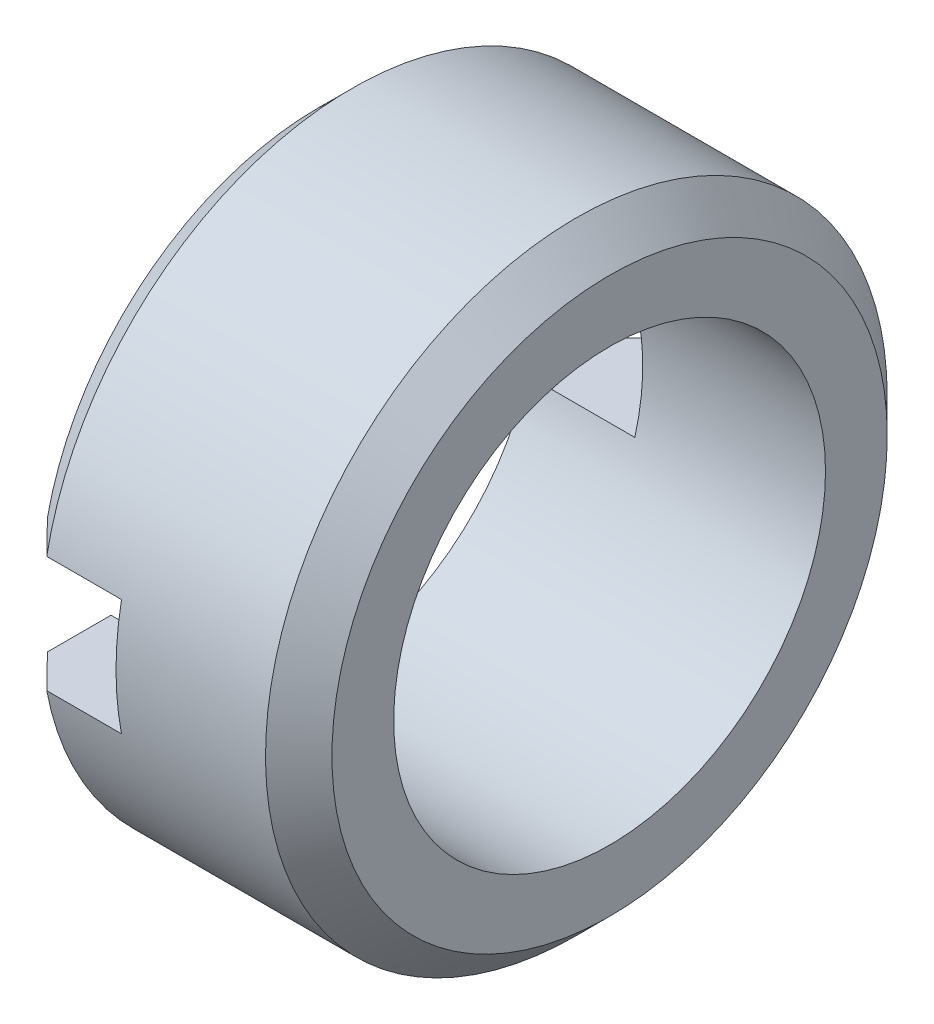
ISO-10303-21;
HEADER;
FILE_DESCRIPTION(('STEP AP214'),'2;1');
FILE_NAME('part.step','',(''),(''),'','','');
FILE_SCHEMA(('AUTOMOTIVE_DESIGN { 1 0 10303 214 1 1 1 1 }'));
ENDSEC;
DATA;
#1=APPLICATION_CONTEXT('core data for automotive mechanical design processes');
#2=APPLICATION_PROTOCOL_DEFINITION('international standard','automotive_design',2000,#1);
#3=PRODUCT_CONTEXT('',#1,'mechanical');
#4=PRODUCT('Part','Part','',(#3));
#5=PRODUCT_RELATED_PRODUCT_CATEGORY('part','',(#4));
#6=PRODUCT_DEFINITION_FORMATION('','',#4);
#7=PRODUCT_DEFINITION_CONTEXT('part definition',#1,'design');
#8=PRODUCT_DEFINITION('design','',#6,#7);
#9=PRODUCT_DEFINITION_SHAPE('','',#8);
#10=(LENGTH_UNIT() NAMED_UNIT(*) SI_UNIT(.MILLI.,.METRE.));
#11=(NAMED_UNIT(*) PLANE_ANGLE_UNIT() SI_UNIT($,.RADIAN.));
#12=(NAMED_UNIT(*) SI_UNIT($,.STERADIAN.) SOLID_ANGLE_UNIT());
#13=UNCERTAINTY_MEASURE_WITH_UNIT(LENGTH_MEASURE(1.E-05),#10,'distance_accuracy_value','');
#14=(GEOMETRIC_REPRESENTATION_CONTEXT(3) GLOBAL_UNCERTAINTY_ASSIGNED_CONTEXT((#13)) GLOBAL_UNIT_ASSIGNED_CONTEXT((#10,
#11,#12)) REPRESENTATION_CONTEXT('',''));
#15=CARTESIAN_POINT('',(0.,0.,0.));
#16=DIRECTION('',(0.,0.,1.));
#17=DIRECTION('',(1.,0.,0.));
#18=AXIS2_PLACEMENT_3D('',#15,#16,#17);
#19=CARTESIAN_POINT('',(0.,0.,0.));
#20=DIRECTION('',(1.,0.,0.));
#21=DIRECTION('',(0.,0.,-1.));
#22=AXIS2_PLACEMENT_3D('',#19,#20,#21);
#23=PLANE('',#22);
#24=DIRECTION('',(0.,0.,-1.));
#25=VECTOR('',#24,1.);
#26=CARTESIAN_POINT('',(0.,-1.778,9.50849));
#27=LINE('',#26,#25);
#28=CARTESIAN_POINT('',(0.,-1.778,-6.36015188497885));
#29=VERTEX_POINT('',#28);
#30=CARTESIAN_POINT('',(0.,-1.778,-8.30428217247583));
#31=VERTEX_POINT('',#30);
#32=EDGE_CURVE('E311',#29,#31,#27,.T.);
#33=ORIENTED_EDGE('',*,*,#32,.T.);
#34=CARTESIAN_POINT('',(0.,0.,0.));
#35=DIRECTION('',(1.,0.,0.));
#36=DIRECTION('',(0.,0.,-1.));
#37=AXIS2_PLACEMENT_3D('',#34,#35,#36);
#38=CIRCLE('',#37,8.49248999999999);
#39=CARTESIAN_POINT('',(0.,-1.778,8.30428217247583));
#40=VERTEX_POINT('',#39);
#41=EDGE_CURVE('E143',#31,#40,#38,.F.);
#42=ORIENTED_EDGE('',*,*,#41,.T.);
#43=CARTESIAN_POINT('',(0.,-1.778,6.36015188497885));
#44=VERTEX_POINT('',#43);
#45=EDGE_CURVE('E309',#40,#44,#27,.T.);
#46=ORIENTED_EDGE('',*,*,#45,.T.);
#47=CARTESIAN_POINT('',(0.,0.,0.));
#48=DIRECTION('',(1.,0.,0.));
#49=DIRECTION('',(0.,0.,-1.));
#50=AXIS2_PLACEMENT_3D('',#47,#48,#49);
#51=CIRCLE('',#50,6.604);
#52=EDGE_CURVE('E127',#44,#29,#51,.T.);
#53=ORIENTED_EDGE('',*,*,#52,.T.);
#54=EDGE_LOOP('',(#33,#42,#46,#53));
#55=FACE_BOUND('',#54,.T.);
#56=ADVANCED_FACE('F26',(#55),#23,.F.);
#57=DIRECTION('',(0.,0.,1.));
#58=VECTOR('',#57,1.);
#59=CARTESIAN_POINT('',(0.,1.778,9.50849));
#60=LINE('',#59,#58);
#61=CARTESIAN_POINT('',(0.,1.778,6.36015188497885));
#62=VERTEX_POINT('',#61);
#63=CARTESIAN_POINT('',(0.,1.778,8.30428217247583));
#64=VERTEX_POINT('',#63);
#65=EDGE_CURVE('E121',#62,#64,#60,.T.);
#66=ORIENTED_EDGE('',*,*,#65,.T.);
#67=CARTESIAN_POINT('',(0.,1.778,-8.30428217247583));
#68=VERTEX_POINT('',#67);
#69=EDGE_CURVE('E119',#64,#68,#38,.F.);
#70=ORIENTED_EDGE('',*,*,#69,.T.);
#71=CARTESIAN_POINT('',(0.,1.778,-6.36015188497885));
#72=VERTEX_POINT('',#71);
#73=EDGE_CURVE('E49',#68,#72,#60,.T.);
#74=ORIENTED_EDGE('',*,*,#73,.T.);
#75=EDGE_CURVE('E117',#72,#62,#51,.T.);
#76=ORIENTED_EDGE('',*,*,#75,.T.);
#77=EDGE_LOOP('',(#66,#70,#74,#76));
#78=FACE_BOUND('',#77,.T.);
#79=ADVANCED_FACE('F116',(#78),#23,.F.);
#80=CARTESIAN_POINT('',(8.89,0.,0.));
#81=DIRECTION('',(-1.,0.,0.));
#82=DIRECTION('',(0.,0.,1.));
#83=AXIS2_PLACEMENT_3D('',#80,#81,#82);
#84=CYLINDRICAL_SURFACE('',#83,9.50849);
#85=CARTESIAN_POINT('',(7.874,0.,0.));
#86=DIRECTION('',(1.,0.,0.));
#87=DIRECTION('',(0.,0.,-1.));
#88=AXIS2_PLACEMENT_3D('',#85,#86,#87);
#89=CIRCLE('',#88,9.50849);
#90=CARTESIAN_POINT('',(7.874,0.,-9.50849));
#91=VERTEX_POINT('',#90);
#92=EDGE_CURVE('E130',#91,#91,#89,.F.);
#93=ORIENTED_EDGE('',*,*,#92,.T.);
#94=EDGE_LOOP('',(#93));
#95=FACE_BOUND('',#94,.T.);
#96=DIRECTION('',(-1.,0.,0.));
#97=VECTOR('',#96,1.);
#98=CARTESIAN_POINT('',(8.89,-1.778,-9.34077609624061));
#99=LINE('',#98,#97);
#100=CARTESIAN_POINT('',(3.302,-1.778,-9.34077609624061));
#101=VERTEX_POINT('',#100);
#102=CARTESIAN_POINT('',(1.016,-1.778,-9.34077609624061));
#103=VERTEX_POINT('',#102);
#104=EDGE_CURVE('E208',#101,#103,#99,.T.);
#105=ORIENTED_EDGE('',*,*,#104,.F.);
#106=CARTESIAN_POINT('',(3.302,0.,0.));
#107=DIRECTION('',(-1.,0.,0.));
#108=DIRECTION('',(0.,0.,1.));
#109=AXIS2_PLACEMENT_3D('',#106,#107,#108);
#110=CIRCLE('',#109,9.50849);
#111=CARTESIAN_POINT('',(3.302,1.778,-9.34077609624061));
#112=VERTEX_POINT('',#111);
#113=EDGE_CURVE('E133',#112,#101,#110,.T.);
#114=ORIENTED_EDGE('',*,*,#113,.F.);
#115=DIRECTION('',(-1.,0.,0.));
#116=VECTOR('',#115,1.);
#117=CARTESIAN_POINT('',(8.89,1.778,-9.34077609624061));
#118=LINE('',#117,#116);
#119=CARTESIAN_POINT('',(1.016,1.778,-9.34077609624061));
#120=VERTEX_POINT('',#119);
#121=EDGE_CURVE('E110',#120,#112,#118,.F.);
#122=ORIENTED_EDGE('',*,*,#121,.F.);
#123=CARTESIAN_POINT('',(1.016,0.,0.));
#124=DIRECTION('',(1.,0.,0.));
#125=DIRECTION('',(0.,0.,-1.));
#126=AXIS2_PLACEMENT_3D('',#123,#124,#125);
#127=CIRCLE('',#126,9.50849);
#128=CARTESIAN_POINT('',(1.016,1.778,9.34077609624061));
#129=VERTEX_POINT('',#128);
#130=EDGE_CURVE('E142',#120,#129,#127,.T.);
#131=ORIENTED_EDGE('',*,*,#130,.T.);
#132=DIRECTION('',(-1.,0.,0.));
#133=VECTOR('',#132,1.);
#134=CARTESIAN_POINT('',(8.89,1.778,9.34077609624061));
#135=LINE('',#134,#133);
#136=CARTESIAN_POINT('',(3.302,1.778,9.34077609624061));
#137=VERTEX_POINT('',#136);
#138=EDGE_CURVE('E41',#137,#129,#135,.T.);
#139=ORIENTED_EDGE('',*,*,#138,.F.);
#140=CARTESIAN_POINT('',(3.302,-1.778,9.34077609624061));
#141=VERTEX_POINT('',#140);
#142=EDGE_CURVE('E214',#141,#137,#110,.T.);
#143=ORIENTED_EDGE('',*,*,#142,.F.);
#144=DIRECTION('',(-1.,0.,0.));
#145=VECTOR('',#144,1.);
#146=CARTESIAN_POINT('',(8.89,-1.778,9.34077609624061));
#147=LINE('',#146,#145);
#148=CARTESIAN_POINT('',(1.016,-1.778,9.34077609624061));
#149=VERTEX_POINT('',#148);
#150=EDGE_CURVE('E205',#149,#141,#147,.F.);
#151=ORIENTED_EDGE('',*,*,#150,.F.);
#152=EDGE_CURVE('E139',#149,#103,#127,.T.);
#153=ORIENTED_EDGE('',*,*,#152,.T.);
#154=EDGE_LOOP('',(#105,#114,#122,#131,#139,#143,#151,#153));
#155=FACE_BOUND('',#154,.T.);
#156=ADVANCED_FACE('F28',(#95,#155),#84,.T.);
#157=CARTESIAN_POINT('',(8.89,0.,0.));
#158=DIRECTION('',(-1.,0.,0.));
#159=DIRECTION('',(0.,0.,1.));
#160=AXIS2_PLACEMENT_3D('',#157,#158,#159);
#161=CYLINDRICAL_SURFACE('',#160,6.604);
#162=CARTESIAN_POINT('',(8.89,0.,0.));
#163=DIRECTION('',(1.,0.,0.));
#164=DIRECTION('',(0.,0.,-1.));
#165=AXIS2_PLACEMENT_3D('',#162,#163,#164);
#166=CIRCLE('',#165,6.604);
#167=CARTESIAN_POINT('',(8.89,0.,-6.604));
#168=VERTEX_POINT('',#167);
#169=EDGE_CURVE('E126',#168,#168,#166,.T.);
#170=ORIENTED_EDGE('',*,*,#169,.T.);
#171=EDGE_LOOP('',(#170));
#172=FACE_BOUND('',#171,.T.);
#173=CARTESIAN_POINT('',(3.302,0.,0.));
#174=DIRECTION('',(-1.,0.,0.));
#175=DIRECTION('',(0.,0.,1.));
#176=AXIS2_PLACEMENT_3D('',#173,#174,#175);
#177=CIRCLE('',#176,6.604);
#178=CARTESIAN_POINT('',(3.302,1.778,-6.36015188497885));
#179=VERTEX_POINT('',#178);
#180=CARTESIAN_POINT('',(3.302,-1.778,-6.36015188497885));
#181=VERTEX_POINT('',#180);
#182=EDGE_CURVE('E11',#179,#181,#177,.T.);
#183=ORIENTED_EDGE('',*,*,#182,.T.);
#184=DIRECTION('',(-1.,0.,0.));
#185=VECTOR('',#184,1.);
#186=CARTESIAN_POINT('',(8.89,-1.778,-6.36015188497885));
#187=LINE('',#186,#185);
#188=EDGE_CURVE('E212',#181,#29,#187,.T.);
#189=ORIENTED_EDGE('',*,*,#188,.T.);
#190=ORIENTED_EDGE('',*,*,#52,.F.);
#191=DIRECTION('',(-1.,0.,0.));
#192=VECTOR('',#191,1.);
#193=CARTESIAN_POINT('',(8.89,-1.778,6.36015188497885));
#194=LINE('',#193,#192);
#195=CARTESIAN_POINT('',(3.302,-1.778,6.36015188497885));
#196=VERTEX_POINT('',#195);
#197=EDGE_CURVE('E210',#44,#196,#194,.F.);
#198=ORIENTED_EDGE('',*,*,#197,.T.);
#199=CARTESIAN_POINT('',(3.302,1.778,6.36015188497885));
#200=VERTEX_POINT('',#199);
#201=EDGE_CURVE('E30',#196,#200,#177,.T.);
#202=ORIENTED_EDGE('',*,*,#201,.T.);
#203=DIRECTION('',(-1.,0.,0.));
#204=VECTOR('',#203,1.);
#205=CARTESIAN_POINT('',(8.89,1.778,6.36015188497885));
#206=LINE('',#205,#204);
#207=EDGE_CURVE('E109',#200,#62,#206,.T.);
#208=ORIENTED_EDGE('',*,*,#207,.T.);
#209=ORIENTED_EDGE('',*,*,#75,.F.);
#210=DIRECTION('',(-1.,0.,0.));
#211=VECTOR('',#210,1.);
#212=CARTESIAN_POINT('',(8.89,1.778,-6.36015188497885));
#213=LINE('',#212,#211);
#214=EDGE_CURVE('E103',#72,#179,#213,.F.);
#215=ORIENTED_EDGE('',*,*,#214,.T.);
#216=EDGE_LOOP('',(#183,#189,#190,#198,#202,#208,#209,#215));
#217=FACE_BOUND('',#216,.T.);
#218=ADVANCED_FACE('F124',(#172,#217),#161,.F.);
#219=CARTESIAN_POINT('',(1.016,0.,0.));
#220=DIRECTION('',(1.,0.,0.));
#221=DIRECTION('',(0.,0.,-1.));
#222=AXIS2_PLACEMENT_3D('',#219,#220,#221);
#223=CONICAL_SURFACE('',#222,9.50849,0.78539816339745);
#224=ORIENTED_EDGE('',*,*,#41,.F.);
#225=CARTESIAN_POINT('',(-6.51939398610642,-1.778,-0.855467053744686));
#226=CARTESIAN_POINT('',(-6.48910878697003,-1.778,-0.925211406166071));
#227=CARTESIAN_POINT('',(-6.45639928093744,-1.778,-0.993832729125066));
#228=CARTESIAN_POINT('',(-6.38713141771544,-1.778,-1.12901116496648));
#229=CARTESIAN_POINT('',(-6.35057772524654,-1.778,-1.19557065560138));
#230=CARTESIAN_POINT('',(-6.2746838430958,-1.778,-1.32673165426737));
#231=CARTESIAN_POINT('',(-6.23535439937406,-1.778,-1.3913394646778));
#232=CARTESIAN_POINT('',(-6.15441241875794,-1.778,-1.5191326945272));
#233=CARTESIAN_POINT('',(-6.11279910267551,-1.778,-1.58231761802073));
#234=CARTESIAN_POINT('',(-5.98575080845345,-1.778,-1.76942572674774));
#235=CARTESIAN_POINT('',(-5.89770464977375,-1.778,-1.89157385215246));
#236=CARTESIAN_POINT('',(-5.76224795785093,-1.778,-2.07231717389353));
#237=CARTESIAN_POINT('',(-5.71650233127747,-1.778,-2.13218741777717));
#238=CARTESIAN_POINT('',(-5.62407546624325,-1.778,-2.25120627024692));
#239=CARTESIAN_POINT('',(-5.57739420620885,-1.778,-2.31035486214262));
#240=CARTESIAN_POINT('',(-5.43755284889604,-1.778,-2.48520028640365));
#241=CARTESIAN_POINT('',(-5.34329184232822,-1.778,-2.60001525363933));
#242=CARTESIAN_POINT('',(-5.15267173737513,-1.778,-2.82789392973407));
#243=CARTESIAN_POINT('',(-5.05631249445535,-1.778,-2.94095751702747));
#244=CARTESIAN_POINT('',(-4.86203433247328,-1.778,-3.16577388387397));
#245=CARTESIAN_POINT('',(-4.76411510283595,-1.778,-3.27752639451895));
#246=CARTESIAN_POINT('',(-4.56710894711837,-1.778,-3.49999853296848));
#247=CARTESIAN_POINT('',(-4.46802200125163,-1.778,-3.61071814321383));
#248=CARTESIAN_POINT('',(-4.16940889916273,-1.778,-3.94168384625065));
#249=CARTESIAN_POINT('',(-3.96854409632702,-1.778,-4.16072121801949));
#250=CARTESIAN_POINT('',(-3.56459796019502,-1.778,-4.59668162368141));
#251=CARTESIAN_POINT('',(-3.36151690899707,-1.778,-4.81360492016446));
#252=CARTESIAN_POINT('',(-2.95276573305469,-1.778,-5.24714287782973));
#253=CARTESIAN_POINT('',(-2.74708762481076,-1.778,-5.46375000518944));
#254=CARTESIAN_POINT('',(-2.33463688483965,-1.778,-5.89593112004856));
#255=CARTESIAN_POINT('',(-2.12786421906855,-1.778,-6.11150507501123));
#256=CARTESIAN_POINT('',(-1.5064523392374,-1.778,-6.7570075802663));
#257=CARTESIAN_POINT('',(-1.0906369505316,-1.778,-7.18580351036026));
#258=CARTESIAN_POINT('',(-0.519018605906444,-1.778,-7.77278632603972));
#259=CARTESIAN_POINT('',(-0.363991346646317,-1.778,-7.93173128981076));
#260=CARTESIAN_POINT('',(-0.053929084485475,-1.778,-8.24919349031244));
#261=CARTESIAN_POINT('',(0.101105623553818,-1.778,-8.4077110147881));
#262=CARTESIAN_POINT('',(0.851886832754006,-1.778,-9.17450392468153));
#263=CARTESIAN_POINT('',(1.44884545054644,-1.778,-9.78159219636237));
#264=CARTESIAN_POINT('',(2.64422458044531,-1.778,-10.9943327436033));
#265=CARTESIAN_POINT('',(3.242645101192,-1.778,-11.5999850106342));
#266=CARTESIAN_POINT('',(4.44425086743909,-1.778,-12.81427985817));
#267=CARTESIAN_POINT('',(5.04744200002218,-1.778,-13.4229166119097));
#268=CARTESIAN_POINT('',(6.25445422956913,-1.778,-14.6395535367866));
#269=CARTESIAN_POINT('',(6.8582753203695,-1.778,-15.2475537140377));
#270=CARTESIAN_POINT('',(7.4622702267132,-1.778,-15.8553804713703));
#271=B_SPLINE_CURVE_WITH_KNOTS('',3,(#225,#226,#227,#228,#229,#230,#231,#232,#233,#234,#235,
#236,#237,#238,#239,#240,#241,#242,#243,#244,#245,#246,#247,#248,#249,#250,#251,#252,#253,#254,
#255,#256,#257,#258,#259,#260,#261,#262,#263,#264,#265,#266,#267,#268,#269,#270),.UNSPECIFIED.,
.F.,.F.,(4,2,2,2,2,2,2,2,2,2,2,2,2,2,2,2,2,2,2,2,2,2,4),(0.,0.227968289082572,0.455663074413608,
0.682520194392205,0.909455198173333,1.3609796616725,1.58701668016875,1.81305891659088,
2.25867529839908,2.70432247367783,3.15005950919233,3.5958041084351,4.48735540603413,
5.37879451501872,6.27489106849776,7.17101565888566,8.9629061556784,9.62899380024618,
10.2941793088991,12.8484333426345,15.4027025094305,17.9734029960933,20.544078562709),.UNSPECIFIED.);
#272=EDGE_CURVE('E183',#31,#103,#271,.T.);
#273=ORIENTED_EDGE('',*,*,#272,.T.);
#274=ORIENTED_EDGE('',*,*,#152,.F.);
#275=CARTESIAN_POINT('',(7.4622702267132,-1.778,15.8553804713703));
#276=CARTESIAN_POINT('',(6.85984381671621,-1.778,15.2491312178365));
#277=CARTESIAN_POINT('',(6.25758956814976,-1.778,14.6427101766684));
#278=CARTESIAN_POINT('',(5.05390389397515,-1.778,13.429433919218));
#279=CARTESIAN_POINT('',(4.45247226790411,-1.778,12.8225789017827));
#280=CARTESIAN_POINT('',(3.55127360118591,-1.778,11.911877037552));
#281=CARTESIAN_POINT('',(3.25116188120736,-1.778,11.6083713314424));
#282=CARTESIAN_POINT('',(2.65123574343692,-1.778,11.0010717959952));
#283=CARTESIAN_POINT('',(2.3514213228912,-1.778,10.6972779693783));
#284=CARTESIAN_POINT('',(1.75207970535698,-1.778,10.0892295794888));
#285=CARTESIAN_POINT('',(1.45255261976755,-1.778,9.78497490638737));
#286=CARTESIAN_POINT('',(0.853982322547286,-1.778,9.17596949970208));
#287=CARTESIAN_POINT('',(0.554939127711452,-1.778,8.87121874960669));
#288=CARTESIAN_POINT('',(-0.0430237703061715,-1.778,8.26051237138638));
#289=CARTESIAN_POINT('',(-0.341942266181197,-1.778,7.95455556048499));
#290=CARTESIAN_POINT('',(-0.938810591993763,-1.778,7.34177125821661));
#291=CARTESIAN_POINT('',(-1.2367605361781,-1.778,7.03494387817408));
#292=CARTESIAN_POINT('',(-1.83103232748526,-1.778,6.42027673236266));
#293=CARTESIAN_POINT('',(-2.12735545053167,-1.778,6.11243820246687));
#294=CARTESIAN_POINT('',(-2.57034150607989,-1.778,5.64912180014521));
#295=CARTESIAN_POINT('',(-2.71778482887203,-1.778,5.49439028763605));
#296=CARTESIAN_POINT('',(-3.01200698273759,-1.778,5.18428590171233));
#297=CARTESIAN_POINT('',(-3.15878579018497,-1.778,5.02891300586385));
#298=CARTESIAN_POINT('',(-3.45195871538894,-1.778,4.71683612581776));
#299=CARTESIAN_POINT('',(-3.5983499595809,-1.778,4.56012943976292));
#300=CARTESIAN_POINT('',(-3.88994937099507,-1.778,4.24565319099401));
#301=CARTESIAN_POINT('',(-4.03515768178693,-1.778,4.08788376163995));
#302=CARTESIAN_POINT('',(-4.32376168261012,-1.778,3.77111019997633));
#303=CARTESIAN_POINT('',(-4.46715968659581,-1.778,3.61210817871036));
#304=CARTESIAN_POINT('',(-4.75174879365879,-1.778,3.29200153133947));
#305=CARTESIAN_POINT('',(-4.89293887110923,-1.778,3.13089598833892));
#306=CARTESIAN_POINT('',(-5.10250501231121,-1.778,2.88659933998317));
#307=CARTESIAN_POINT('',(-5.17216728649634,-1.778,2.80451231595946));
#308=CARTESIAN_POINT('',(-5.31038768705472,-1.778,2.63941964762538));
#309=CARTESIAN_POINT('',(-5.3789458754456,-1.778,2.55641405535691));
#310=CARTESIAN_POINT('',(-5.51457118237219,-1.778,2.3893704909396));
#311=CARTESIAN_POINT('',(-5.58164013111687,-1.778,2.3053340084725));
#312=CARTESIAN_POINT('',(-5.71397031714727,-1.778,2.13581335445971));
#313=CARTESIAN_POINT('',(-5.77923114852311,-1.778,2.0503288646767));
#314=CARTESIAN_POINT('',(-5.90769071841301,-1.778,1.87704737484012));
#315=CARTESIAN_POINT('',(-5.9708752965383,-1.778,1.78923983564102));
#316=CARTESIAN_POINT('',(-6.09384177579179,-1.778,1.61132647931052));
#317=CARTESIAN_POINT('',(-6.15362579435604,-1.778,1.5212221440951));
#318=CARTESIAN_POINT('',(-6.23985309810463,-1.778,1.38360608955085));
#319=CARTESIAN_POINT('',(-6.26808224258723,-1.778,1.33721355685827));
#320=CARTESIAN_POINT('',(-6.32308113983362,-1.778,1.24357866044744));
#321=CARTESIAN_POINT('',(-6.34985113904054,-1.778,1.1963364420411));
#322=CARTESIAN_POINT('',(-6.40169721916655,-1.778,1.10079382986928));
#323=CARTESIAN_POINT('',(-6.42676956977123,-1.778,1.05249139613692));
#324=CARTESIAN_POINT('',(-6.47478308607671,-1.778,0.954806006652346));
#325=CARTESIAN_POINT('',(-6.49772297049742,-1.778,0.905422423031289));
#326=CARTESIAN_POINT('',(-6.51939398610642,-1.778,0.855467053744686));
#327=B_SPLINE_CURVE_WITH_KNOTS('',3,(#275,#276,#277,#278,#279,#280,#281,#282,#283,#284,#285,
#286,#287,#288,#289,#290,#291,#292,#293,#294,#295,#296,#297,#298,#299,#300,#301,#302,#303,#304,
#305,#306,#307,#308,#309,#310,#311,#312,#313,#314,#315,#316,#317,#318,#319,#320,#321,#322,#323,
#324,#325,#326),.UNSPECIFIED.,.F.,.F.,(4,2,2,2,2,2,2,2,2,2,2,2,2,2,2,2,2,2,2,2,2,2,2,2,2,4),(0.,
2.56400188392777,5.12719011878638,6.40767612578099,7.68815015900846,8.96900352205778,
10.2499004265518,11.5331200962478,12.8161824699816,14.0980281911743,14.7392227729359,
15.3804399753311,16.0237758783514,16.667032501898,17.3093605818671,17.9519786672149,
18.2749575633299,18.5979182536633,18.9204572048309,19.2430679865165,19.5675504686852,
19.8918286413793,20.0547258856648,20.2175955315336,20.3808121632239,20.5441262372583),.UNSPECIFIED.);
#328=EDGE_CURVE('E179',#149,#40,#327,.T.);
#329=ORIENTED_EDGE('',*,*,#328,.T.);
#330=EDGE_LOOP('',(#224,#273,#274,#329));
#331=FACE_BOUND('',#330,.T.);
#332=ADVANCED_FACE('F161',(#331),#223,.T.);
#333=ORIENTED_EDGE('',*,*,#130,.F.);
#334=CARTESIAN_POINT('',(7.4622702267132,1.778,-15.8553804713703));
#335=CARTESIAN_POINT('',(6.85984381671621,1.778,-15.2491312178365));
#336=CARTESIAN_POINT('',(6.25758956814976,1.778,-14.6427101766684));
#337=CARTESIAN_POINT('',(5.05390389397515,1.778,-13.429433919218));
#338=CARTESIAN_POINT('',(4.45247226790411,1.778,-12.8225789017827));
#339=CARTESIAN_POINT('',(3.55127360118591,1.778,-11.911877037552));
#340=CARTESIAN_POINT('',(3.25116188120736,1.778,-11.6083713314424));
#341=CARTESIAN_POINT('',(2.65123574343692,1.778,-11.0010717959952));
#342=CARTESIAN_POINT('',(2.3514213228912,1.778,-10.6972779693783));
#343=CARTESIAN_POINT('',(1.75207970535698,1.778,-10.0892295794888));
#344=CARTESIAN_POINT('',(1.45255261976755,1.778,-9.78497490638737));
#345=CARTESIAN_POINT('',(0.853982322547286,1.778,-9.17596949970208));
#346=CARTESIAN_POINT('',(0.554939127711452,1.778,-8.87121874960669));
#347=CARTESIAN_POINT('',(-0.0430237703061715,1.778,-8.26051237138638));
#348=CARTESIAN_POINT('',(-0.341942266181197,1.778,-7.95455556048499));
#349=CARTESIAN_POINT('',(-0.938810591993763,1.778,-7.34177125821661));
#350=CARTESIAN_POINT('',(-1.2367605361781,1.778,-7.03494387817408));
#351=CARTESIAN_POINT('',(-1.83103232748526,1.778,-6.42027673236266));
#352=CARTESIAN_POINT('',(-2.12735545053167,1.778,-6.11243820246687));
#353=CARTESIAN_POINT('',(-2.57034150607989,1.778,-5.64912180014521));
#354=CARTESIAN_POINT('',(-2.71778482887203,1.778,-5.49439028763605));
#355=CARTESIAN_POINT('',(-3.01200698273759,1.778,-5.18428590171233));
#356=CARTESIAN_POINT('',(-3.15878579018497,1.778,-5.02891300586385));
#357=CARTESIAN_POINT('',(-3.45195871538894,1.778,-4.71683612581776));
#358=CARTESIAN_POINT('',(-3.5983499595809,1.778,-4.56012943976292));
#359=CARTESIAN_POINT('',(-3.88994937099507,1.778,-4.24565319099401));
#360=CARTESIAN_POINT('',(-4.03515768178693,1.778,-4.08788376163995));
#361=CARTESIAN_POINT('',(-4.32376168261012,1.778,-3.77111019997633));
#362=CARTESIAN_POINT('',(-4.46715968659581,1.778,-3.61210817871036));
#363=CARTESIAN_POINT('',(-4.75174879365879,1.778,-3.29200153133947));
#364=CARTESIAN_POINT('',(-4.89293887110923,1.778,-3.13089598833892));
#365=CARTESIAN_POINT('',(-5.10250501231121,1.778,-2.88659933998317));
#366=CARTESIAN_POINT('',(-5.17216728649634,1.778,-2.80451231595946));
#367=CARTESIAN_POINT('',(-5.31038768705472,1.778,-2.63941964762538));
#368=CARTESIAN_POINT('',(-5.3789458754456,1.778,-2.55641405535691));
#369=CARTESIAN_POINT('',(-5.51457118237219,1.778,-2.3893704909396));
#370=CARTESIAN_POINT('',(-5.58164013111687,1.778,-2.3053340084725));
#371=CARTESIAN_POINT('',(-5.71397031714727,1.778,-2.13581335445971));
#372=CARTESIAN_POINT('',(-5.77923114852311,1.778,-2.0503288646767));
#373=CARTESIAN_POINT('',(-5.90769071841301,1.778,-1.87704737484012));
#374=CARTESIAN_POINT('',(-5.9708752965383,1.778,-1.78923983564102));
#375=CARTESIAN_POINT('',(-6.09384177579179,1.778,-1.61132647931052));
#376=CARTESIAN_POINT('',(-6.15362579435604,1.778,-1.5212221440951));
#377=CARTESIAN_POINT('',(-6.23985309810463,1.778,-1.38360608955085));
#378=CARTESIAN_POINT('',(-6.26808224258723,1.778,-1.33721355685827));
#379=CARTESIAN_POINT('',(-6.32308113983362,1.778,-1.24357866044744));
#380=CARTESIAN_POINT('',(-6.34985113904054,1.778,-1.1963364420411));
#381=CARTESIAN_POINT('',(-6.40169721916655,1.778,-1.10079382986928));
#382=CARTESIAN_POINT('',(-6.42676956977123,1.778,-1.05249139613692));
#383=CARTESIAN_POINT('',(-6.47478308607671,1.778,-0.954806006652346));
#384=CARTESIAN_POINT('',(-6.49772297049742,1.778,-0.905422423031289));
#385=CARTESIAN_POINT('',(-6.51939398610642,1.778,-0.855467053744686));
#386=B_SPLINE_CURVE_WITH_KNOTS('',3,(#334,#335,#336,#337,#338,#339,#340,#341,#342,#343,#344,
#345,#346,#347,#348,#349,#350,#351,#352,#353,#354,#355,#356,#357,#358,#359,#360,#361,#362,#363,
#364,#365,#366,#367,#368,#369,#370,#371,#372,#373,#374,#375,#376,#377,#378,#379,#380,#381,#382,
#383,#384,#385),.UNSPECIFIED.,.F.,.F.,(4,2,2,2,2,2,2,2,2,2,2,2,2,2,2,2,2,2,2,2,2,2,2,2,2,4),(0.,
2.56400188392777,5.12719011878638,6.40767612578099,7.68815015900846,8.96900352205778,
10.2499004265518,11.5331200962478,12.8161824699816,14.0980281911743,14.7392227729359,
15.3804399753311,16.0237758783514,16.667032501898,17.3093605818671,17.9519786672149,
18.2749575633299,18.5979182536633,18.9204572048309,19.2430679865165,19.5675504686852,
19.8918286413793,20.0547258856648,20.2175955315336,20.3808121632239,20.5441262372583),.UNSPECIFIED.);
#387=EDGE_CURVE('E156',#120,#68,#386,.T.);
#388=ORIENTED_EDGE('',*,*,#387,.T.);
#389=ORIENTED_EDGE('',*,*,#69,.F.);
#390=CARTESIAN_POINT('',(-6.51939398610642,1.778,0.855467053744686));
#391=CARTESIAN_POINT('',(-6.48910878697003,1.778,0.925211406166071));
#392=CARTESIAN_POINT('',(-6.45639928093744,1.778,0.993832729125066));
#393=CARTESIAN_POINT('',(-6.38713141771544,1.778,1.12901116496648));
#394=CARTESIAN_POINT('',(-6.35057772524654,1.778,1.19557065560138));
#395=CARTESIAN_POINT('',(-6.2746838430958,1.778,1.32673165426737));
#396=CARTESIAN_POINT('',(-6.23535439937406,1.778,1.3913394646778));
#397=CARTESIAN_POINT('',(-6.15441241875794,1.778,1.5191326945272));
#398=CARTESIAN_POINT('',(-6.11279910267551,1.778,1.58231761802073));
#399=CARTESIAN_POINT('',(-5.98575080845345,1.778,1.76942572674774));
#400=CARTESIAN_POINT('',(-5.89770464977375,1.778,1.89157385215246));
#401=CARTESIAN_POINT('',(-5.76224795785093,1.778,2.07231717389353));
#402=CARTESIAN_POINT('',(-5.71650233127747,1.778,2.13218741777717));
#403=CARTESIAN_POINT('',(-5.62407546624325,1.778,2.25120627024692));
#404=CARTESIAN_POINT('',(-5.57739420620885,1.778,2.31035486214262));
#405=CARTESIAN_POINT('',(-5.43755284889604,1.778,2.48520028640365));
#406=CARTESIAN_POINT('',(-5.34329184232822,1.778,2.60001525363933));
#407=CARTESIAN_POINT('',(-5.15267173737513,1.778,2.82789392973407));
#408=CARTESIAN_POINT('',(-5.05631249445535,1.778,2.94095751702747));
#409=CARTESIAN_POINT('',(-4.86203433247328,1.778,3.16577388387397));
#410=CARTESIAN_POINT('',(-4.76411510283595,1.778,3.27752639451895));
#411=CARTESIAN_POINT('',(-4.56710894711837,1.778,3.49999853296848));
#412=CARTESIAN_POINT('',(-4.46802200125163,1.778,3.61071814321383));
#413=CARTESIAN_POINT('',(-4.16940889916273,1.778,3.94168384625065));
#414=CARTESIAN_POINT('',(-3.96854409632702,1.778,4.16072121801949));
#415=CARTESIAN_POINT('',(-3.56459796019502,1.778,4.59668162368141));
#416=CARTESIAN_POINT('',(-3.36151690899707,1.778,4.81360492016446));
#417=CARTESIAN_POINT('',(-2.95276573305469,1.778,5.24714287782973));
#418=CARTESIAN_POINT('',(-2.74708762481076,1.778,5.46375000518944));
#419=CARTESIAN_POINT('',(-2.33463688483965,1.778,5.89593112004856));
#420=CARTESIAN_POINT('',(-2.12786421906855,1.778,6.11150507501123));
#421=CARTESIAN_POINT('',(-1.5064523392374,1.778,6.7570075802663));
#422=CARTESIAN_POINT('',(-1.0906369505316,1.778,7.18580351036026));
#423=CARTESIAN_POINT('',(-0.519018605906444,1.778,7.77278632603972));
#424=CARTESIAN_POINT('',(-0.363991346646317,1.778,7.93173128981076));
#425=CARTESIAN_POINT('',(-0.053929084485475,1.778,8.24919349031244));
#426=CARTESIAN_POINT('',(0.101105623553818,1.778,8.4077110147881));
#427=CARTESIAN_POINT('',(0.851886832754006,1.778,9.17450392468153));
#428=CARTESIAN_POINT('',(1.44884545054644,1.778,9.78159219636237));
#429=CARTESIAN_POINT('',(2.64422458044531,1.778,10.9943327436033));
#430=CARTESIAN_POINT('',(3.242645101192,1.778,11.5999850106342));
#431=CARTESIAN_POINT('',(4.44425086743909,1.778,12.81427985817));
#432=CARTESIAN_POINT('',(5.04744200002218,1.778,13.4229166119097));
#433=CARTESIAN_POINT('',(6.25445422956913,1.778,14.6395535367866));
#434=CARTESIAN_POINT('',(6.8582753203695,1.778,15.2475537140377));
#435=CARTESIAN_POINT('',(7.4622702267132,1.778,15.8553804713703));
#436=B_SPLINE_CURVE_WITH_KNOTS('',3,(#390,#391,#392,#393,#394,#395,#396,#397,#398,#399,#400,
#401,#402,#403,#404,#405,#406,#407,#408,#409,#410,#411,#412,#413,#414,#415,#416,#417,#418,#419,
#420,#421,#422,#423,#424,#425,#426,#427,#428,#429,#430,#431,#432,#433,#434,#435),.UNSPECIFIED.,
.F.,.F.,(4,2,2,2,2,2,2,2,2,2,2,2,2,2,2,2,2,2,2,2,2,2,4),(0.,0.227968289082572,0.455663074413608,
0.682520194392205,0.909455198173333,1.3609796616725,1.58701668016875,1.81305891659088,
2.25867529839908,2.70432247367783,3.15005950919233,3.5958041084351,4.48735540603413,
5.37879451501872,6.27489106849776,7.17101565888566,8.9629061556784,9.62899380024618,
10.2941793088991,12.8484333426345,15.4027025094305,17.9734029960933,20.544078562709),.UNSPECIFIED.);
#437=EDGE_CURVE('E149',#64,#129,#436,.T.);
#438=ORIENTED_EDGE('',*,*,#437,.T.);
#439=EDGE_LOOP('',(#333,#388,#389,#438));
#440=FACE_BOUND('',#439,.T.);
#441=ADVANCED_FACE('F194',(#440),#223,.T.);
#442=CARTESIAN_POINT('',(8.89,0.,0.));
#443=DIRECTION('',(1.,0.,0.));
#444=DIRECTION('',(0.,0.,-1.));
#445=AXIS2_PLACEMENT_3D('',#442,#443,#444);
#446=PLANE('',#445);
#447=CARTESIAN_POINT('',(8.89,0.,0.));
#448=DIRECTION('',(1.,0.,0.));
#449=DIRECTION('',(0.,0.,-1.));
#450=AXIS2_PLACEMENT_3D('',#447,#448,#449);
#451=CIRCLE('',#450,8.49249);
#452=CARTESIAN_POINT('',(8.89,0.,-8.49249));
#453=VERTEX_POINT('',#452);
#454=EDGE_CURVE('E146',#453,#453,#451,.T.);
#455=ORIENTED_EDGE('',*,*,#454,.T.);
#456=EDGE_LOOP('',(#455));
#457=FACE_BOUND('',#456,.T.);
#458=ORIENTED_EDGE('',*,*,#169,.F.);
#459=EDGE_LOOP('',(#458));
#460=FACE_BOUND('',#459,.T.);
#461=ADVANCED_FACE('F230',(#457,#460),#446,.T.);
#462=CARTESIAN_POINT('',(8.89,0.,0.));
#463=DIRECTION('',(-1.,0.,0.));
#464=DIRECTION('',(0.,0.,1.));
#465=AXIS2_PLACEMENT_3D('',#462,#463,#464);
#466=CONICAL_SURFACE('',#465,8.49249,0.785398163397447);
#467=ORIENTED_EDGE('',*,*,#92,.F.);
#468=EDGE_LOOP('',(#467));
#469=FACE_BOUND('',#468,.T.);
#470=ORIENTED_EDGE('',*,*,#454,.F.);
#471=EDGE_LOOP('',(#470));
#472=FACE_BOUND('',#471,.T.);
#473=ADVANCED_FACE('F171',(#469,#472),#466,.T.);
#474=CARTESIAN_POINT('',(3.302,1.778,9.50849));
#475=DIRECTION('',(0.,-1.,0.));
#476=DIRECTION('',(0.,0.,-1.));
#477=AXIS2_PLACEMENT_3D('',#474,#475,#476);
#478=PLANE('',#477);
#479=DIRECTION('',(0.,0.,1.));
#480=VECTOR('',#479,1.);
#481=CARTESIAN_POINT('',(3.302,1.778,9.50849));
#482=LINE('',#481,#480);
#483=EDGE_CURVE('E313',#200,#137,#482,.T.);
#484=ORIENTED_EDGE('',*,*,#483,.T.);
#485=ORIENTED_EDGE('',*,*,#138,.T.);
#486=ORIENTED_EDGE('',*,*,#437,.F.);
#487=ORIENTED_EDGE('',*,*,#65,.F.);
#488=ORIENTED_EDGE('',*,*,#207,.F.);
#489=EDGE_LOOP('',(#484,#485,#486,#487,#488));
#490=FACE_BOUND('',#489,.T.);
#491=ADVANCED_FACE('F165',(#490),#478,.T.);
#492=CARTESIAN_POINT('',(3.302,-1.778,9.50849));
#493=DIRECTION('',(0.,1.,0.));
#494=DIRECTION('',(0.,0.,1.));
#495=AXIS2_PLACEMENT_3D('',#492,#493,#494);
#496=PLANE('',#495);
#497=ORIENTED_EDGE('',*,*,#45,.F.);
#498=ORIENTED_EDGE('',*,*,#328,.F.);
#499=ORIENTED_EDGE('',*,*,#150,.T.);
#500=DIRECTION('',(0.,0.,-1.));
#501=VECTOR('',#500,1.);
#502=CARTESIAN_POINT('',(3.302,-1.778,9.50849));
#503=LINE('',#502,#501);
#504=EDGE_CURVE('E222',#141,#196,#503,.T.);
#505=ORIENTED_EDGE('',*,*,#504,.T.);
#506=ORIENTED_EDGE('',*,*,#197,.F.);
#507=EDGE_LOOP('',(#497,#498,#499,#505,#506));
#508=FACE_BOUND('',#507,.T.);
#509=ADVANCED_FACE('F170',(#508),#496,.T.);
#510=CARTESIAN_POINT('',(3.302,1.778,9.50849));
#511=DIRECTION('',(-1.,0.,0.));
#512=DIRECTION('',(0.,0.,1.));
#513=AXIS2_PLACEMENT_3D('',#510,#511,#512);
#514=PLANE('',#513);
#515=ORIENTED_EDGE('',*,*,#142,.T.);
#516=ORIENTED_EDGE('',*,*,#483,.F.);
#517=ORIENTED_EDGE('',*,*,#201,.F.);
#518=ORIENTED_EDGE('',*,*,#504,.F.);
#519=EDGE_LOOP('',(#515,#516,#517,#518));
#520=FACE_BOUND('',#519,.T.);
#521=ADVANCED_FACE('F287',(#520),#514,.T.);
#522=ORIENTED_EDGE('',*,*,#113,.T.);
#523=EDGE_CURVE('E120',#181,#101,#503,.T.);
#524=ORIENTED_EDGE('',*,*,#523,.F.);
#525=ORIENTED_EDGE('',*,*,#182,.F.);
#526=EDGE_CURVE('E106',#112,#179,#482,.T.);
#527=ORIENTED_EDGE('',*,*,#526,.F.);
#528=EDGE_LOOP('',(#522,#524,#525,#527));
#529=FACE_BOUND('',#528,.T.);
#530=ADVANCED_FACE('F172',(#529),#514,.T.);
#531=ORIENTED_EDGE('',*,*,#523,.T.);
#532=ORIENTED_EDGE('',*,*,#104,.T.);
#533=ORIENTED_EDGE('',*,*,#272,.F.);
#534=ORIENTED_EDGE('',*,*,#32,.F.);
#535=ORIENTED_EDGE('',*,*,#188,.F.);
#536=EDGE_LOOP('',(#531,#532,#533,#534,#535));
#537=FACE_BOUND('',#536,.T.);
#538=ADVANCED_FACE('F173',(#537),#496,.T.);
#539=ORIENTED_EDGE('',*,*,#73,.F.);
#540=ORIENTED_EDGE('',*,*,#387,.F.);
#541=ORIENTED_EDGE('',*,*,#121,.T.);
#542=ORIENTED_EDGE('',*,*,#526,.T.);
#543=ORIENTED_EDGE('',*,*,#214,.F.);
#544=EDGE_LOOP('',(#539,#540,#541,#542,#543));
#545=FACE_BOUND('',#544,.T.);
#546=ADVANCED_FACE('F104',(#545),#478,.T.);
#547=CLOSED_SHELL('',(#56,#79,#156,#218,#332,#441,#461,#473,#491,#509,#521,#530,#538,#546));
#548=MANIFOLD_SOLID_BREP('B2',#547);
#549=ADVANCED_BREP_SHAPE_REPRESENTATION('',(#18,#548),#14);
#550=SHAPE_DEFINITION_REPRESENTATION(#9,#549);
ENDSEC;
END-ISO-10303-21;
